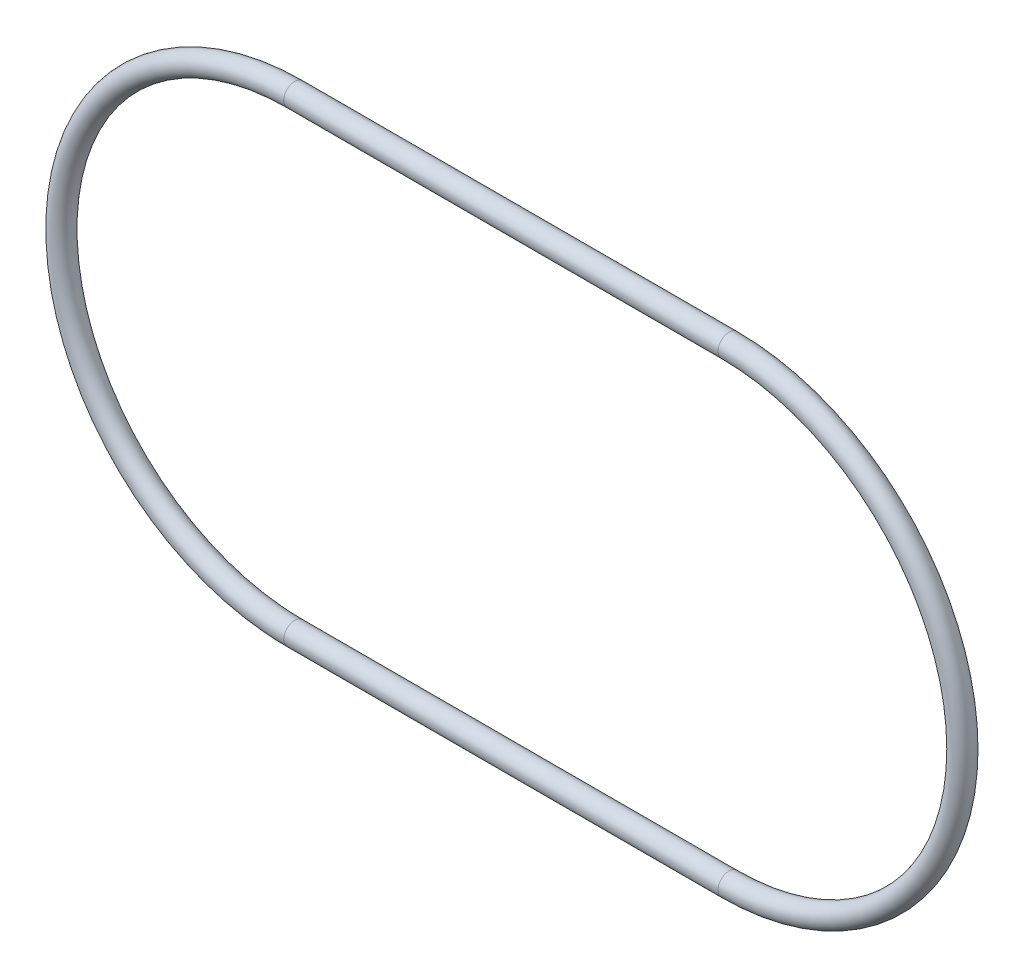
from build123d import *

# Parameters (mm, degrees)
ESQUISSE2_R = 1.5


with BuildPart() as part:
    # Balayage1: sweep along a path in Esquisse1
    with BuildLine(Plane.XY) as balayage1_path:
        Line((0, 31.7), (59, 31.7))
        ThreePointArc((59, 31.7), (90.7, 0), (59, -31.7))
        Line((59, -31.7), (0, -31.7))
        ThreePointArc((0, -31.7), (-31.7, 0), (0, 31.7))
    # Esquisse2 → Balayage1 (sweep)
    with BuildSketch(Plane(origin=(0, 0, 0), x_dir=(0, 0, -1), z_dir=(1, 0, 0))):
        with Locations((0, -31.7)):
            Circle(ESQUISSE2_R)
    sweep(path=balayage1_path.line)


solid = part.part
